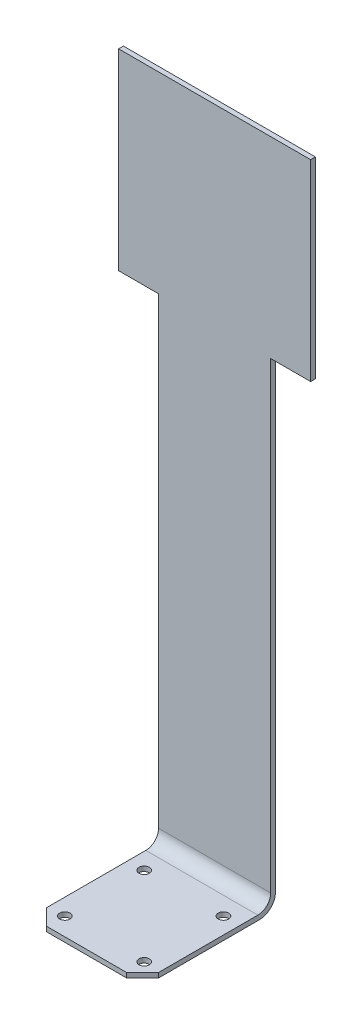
from build123d import *

# Parameters (mm, degrees)
BOSS_EXTRU_1_DEPTH      = 1.5
ESQUISSE2_R             = 15
ENL_V_MAT_EXTRU_1_DEPTH = 425.266720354
ESQUISSE4_W             = 70
ESQUISSE4_H             = 3
BOSS_EXTRU_2_DEPTH      = 80
CONG_1_R                = 10
CONG_2_R                = 8
ESQUISSE5_R             = 3.25
ENL_V_MAT_EXTRU_2_DEPTH = 430.105173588
CHANFREIN1_SIZE         = 10


with BuildPart() as part:
    # Esquisse1 → Boss.-Extru.1 (new, symmetric)
    with BuildSketch(Plane.XY):
        Polygon((-35, -60), (-35, -360), (35, -360), (35, -60), (60, -60), (60, 60), (-60, 60), (-60, -60), align=None)
    extrude(amount=BOSS_EXTRU_1_DEPTH, both=True)

    # Esquisse2 → Enl_v. mat.-Extru.1 (cut, through all)
    with BuildSketch(Plane(origin=(0, 60, 0), x_dir=(1, 0, 0), z_dir=(0, 1, 0))):
        with Locations((-74.924811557, 0)):
            Circle(ESQUISSE2_R)
        with Locations((74.924811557, 0)):
            Circle(ESQUISSE2_R)
    extrude(amount=-ENL_V_MAT_EXTRU_1_DEPTH, mode=Mode.SUBTRACT)

    # Esquisse4 → Boss.-Extru.2 (add)
    with BuildSketch(Plane.XY.offset(1.5)):
        with Locations((0, -358.5)):
            Rectangle(ESQUISSE4_W, ESQUISSE4_H)
    extrude(amount=BOSS_EXTRU_2_DEPTH)

    # Cong_1
    cong_1_edges = [part.edges().sort_by_distance(p)[0] for p in [
        (0, -360, -1.5),
    ]]
    fillet(cong_1_edges, radius=CONG_1_R)

    # Cong_2
    cong_2_edges = [part.edges().sort_by_distance(p)[0] for p in [
        (0, -357, 1.5),
    ]]
    fillet(cong_2_edges, radius=CONG_2_R)

    # Esquisse5 → Enl_v. mat.-Extru.2 (cut, through all)
    with BuildSketch(Plane(origin=(0, -357, 0), x_dir=(1, 0, 0), z_dir=(0, 1, 0))):
        with Locations(Location((-24.748737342, -20.751262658, 0), (0, 0, 270))):
            Circle(ESQUISSE5_R)
        with Locations(Location((24.748737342, -20.751262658, 0), (0, 0, 270))):
            Circle(ESQUISSE5_R)
        with Locations(Location((24.748737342, -70.248737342, 0), (0, 0, 270))):
            Circle(ESQUISSE5_R)
        with Locations(Location((-24.748737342, -70.248737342, 0), (0, 0, 270))):
            Circle(ESQUISSE5_R)
    extrude(amount=-ENL_V_MAT_EXTRU_2_DEPTH, mode=Mode.SUBTRACT)

    # Chanfrein1
    chanfrein1_edges = [part.edges().sort_by_distance(p)[0] for p in [
        (35, -358.5, 81.5),
        (-35, -358.5, 81.5),
    ]]
    chamfer(chanfrein1_edges, length=CHANFREIN1_SIZE)


solid = part.part
